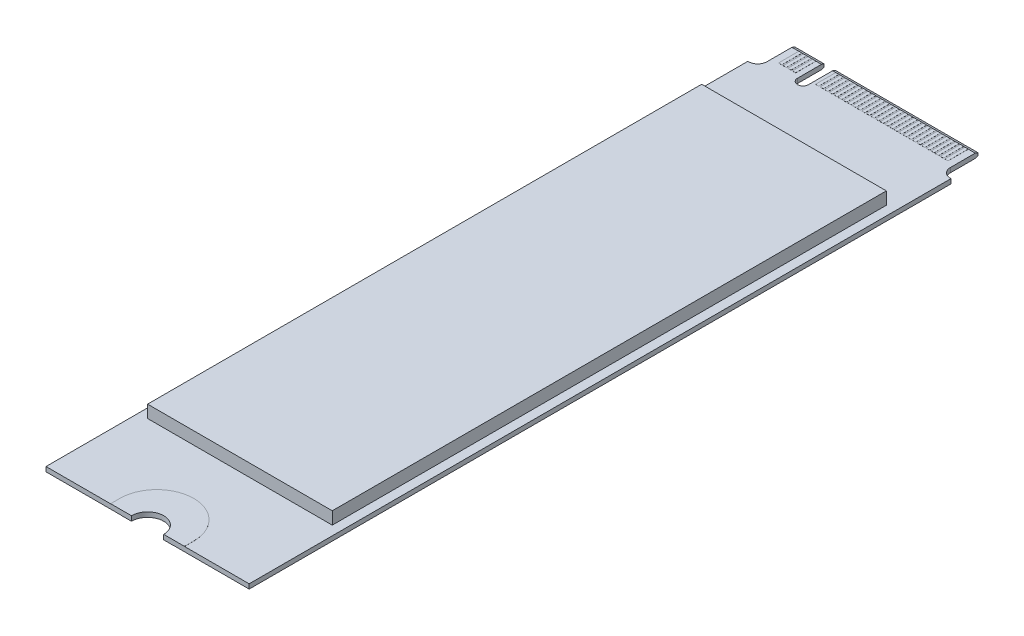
from build123d import *

# Parameters (mm, degrees)
BOSS_EXTRUDE1_DEPTH  = 0.5
CUT_EXTRUDE2_DEPTH   = 46.145383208
SKETCH7_W            = 20
SKETCH7_H            = 60
BOSS_EXTRUDE3_DEPTH  = 1.35
BOSS_EXTRUDE6_DEPTH  = 0.01
BOSS_EXTRUDE9_START  = 0.01
BOSS_EXTRUDE9_DEPTH  = 0.01
BOSS_EXTRUDE10_REACH = 45.572
BOSS_EXTRUDE11_START = -0.5
BOSS_EXTRUDE11_DEPTH = 0.5
SKETCH18_W           = 0.347153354
SKETCH18_H           = 1.7
BOSS_EXTRUDE12_DEPTH = 0.01
SKETCH19_W           = 0.35
SKETCH19_H           = 1.7
BOSS_EXTRUDE13_DEPTH = 0.01
SKETCH21_W           = 0.35
SKETCH21_H           = 2.2
BOSS_EXTRUDE15_DEPTH = 0.01


with BuildPart() as part:
    # Sketch1 → Boss-Extrude1 (new body)
    with BuildSketch(Plane(origin=(0, 0, 0), x_dir=(1, 0, 0), z_dir=(0, 1, 0))):
        with BuildLine():
            Line((1.75, -40), (11, -40))
            Line((11, -40), (11, 36))
            Line((11, 36), (10.925, 36))
            ThreePointArc((10.925, 36), (10.217893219, 36.292893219), (9.925, 37))
            Line((9.925, 37), (9.925, 40))
            Line((9.925, 40), (6.225, 40))
            Line((6.225, 40), (6.225, 37.1))
            ThreePointArc((6.225, 37.1), (5.625, 36.5), (5.025, 37.1))
            Line((5.025, 37.1), (5.025, 40))
            Line((5.025, 40), (0, 40))
            Line((0, 40), (-5.525, 40))
            Line((-5.525, 40), (-5.525, 37.1))
            ThreePointArc((-5.525, 37.1), (-6.125, 36.5), (-6.725, 37.1))
            Line((-6.725, 37.1), (-6.725, 40))
            Line((-6.725, 40), (-9.925, 40))
            Line((-9.925, 40), (-9.925, 37))
            ThreePointArc((-9.925, 37), (-10.217893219, 36.292893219), (-10.925, 36))
            Line((-10.925, 36), (-11, 36))
            Line((-11, 36), (-11, -40))
            Line((-11, -40), (-1.75, -40))
            ThreePointArc((-1.75, -40), (0, -38.25), (1.75, -40))
        make_face()
    extrude(amount=-BOSS_EXTRUDE1_DEPTH)

    # Sketch5 → Cut-Extrude2 (cut, through all)
    with BuildSketch(Plane(origin=(9.925, 0, 0), x_dir=(0, 0, -1), z_dir=(1, 0, 0))):
        Polygon((40, 0), (39.7, 0), (40, -0.10919107), align=None)
        Polygon((40, -0.39080893), (39.7, -0.5), (40, -0.5), align=None)
    extrude(amount=-CUT_EXTRUDE2_DEPTH, mode=Mode.SUBTRACT)

    # Sketch7 → Boss-Extrude3 (add)
    with BuildSketch(Plane(origin=(0, 0, 0), x_dir=(1, 0, 0), z_dir=(0, 1, 0))):
        Rectangle(SKETCH7_W, SKETCH7_H)
    extrude(amount=BOSS_EXTRUDE3_DEPTH)

    # Sketch12 → Boss-Extrude6 (add)
    with BuildSketch(Plane.XZ.offset(0.5)):
        with BuildLine():
            Line((-2.75, 40), (-1.75, 40))
            ThreePointArc((-1.75, 40), (0, 38.25), (1.75, 40))
            Line((1.75, 40), (2.75, 40))
            ThreePointArc((2.75, 40), (0, 37.25), (-2.75, 40))
        make_face()
    extrude(amount=BOSS_EXTRUDE6_DEPTH)

    # Sketch15 → Boss-Extrude9 (add)
    with BuildSketch(Plane(origin=(0, 0, 0), x_dir=(1, 0, 0), z_dir=(0, 1, 0)).offset(BOSS_EXTRUDE9_START)):
        with BuildLine():
            Line((-4, -40), (-4, -39))
            ThreePointArc((-4, -39), (0, -35), (4, -39))
            Line((4, -39), (4, -40))
            Line((4, -40), (1.75, -40))
            ThreePointArc((1.75, -40), (0, -38.25), (-1.75, -40))
            Line((-1.75, -40), (-4, -40))
        make_face()
    extrude(amount=-BOSS_EXTRUDE9_DEPTH)

    # Sketch16 → Boss-Extrude10 (add, up to next)
    with BuildSketch(Plane.ZY.offset(-6.225), mode=Mode.PRIVATE) as boss_extrude10_sk1:
        Polygon((-39.7, -0.5), (-40, -0.39080893), (-40, -0.10919107), (-39.7, 0), (-37.1, 0), (-37.1, -0.5), align=None)
    boss_extrude10_tool1 = extrude(boss_extrude10_sk1.sketch, amount=BOSS_EXTRUDE10_REACH, mode=Mode.PRIVATE) - part.part
    add(boss_extrude10_tool1.solids().sort_by_distance((6.225, -0.25, -38.518797))[0])

    # Sketch17 → Boss-Extrude11 (add)
    with BuildSketch(Plane.XZ.offset(0.5).offset(BOSS_EXTRUDE11_START)):
        with BuildLine():
            Line((5.025, -37.1), (6.225, -37.1))
            ThreePointArc((6.225, -37.1), (5.625, -36.5), (5.025, -37.1))
        make_face()
    extrude(amount=BOSS_EXTRUDE11_DEPTH)

    # Sketch18 → Boss-Extrude12 (add)
    with BuildSketch(Plane.XZ.offset(0.5)):
        with Locations((-9.243710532, -38.85)):
            Rectangle(SKETCH18_W, SKETCH18_H)
        with Locations((-8.743710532, -38.85)):
            Rectangle(SKETCH18_W, SKETCH18_H)
        with Locations((-8.243710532, -38.85)):
            Rectangle(SKETCH18_W, SKETCH18_H)
        with Locations((-7.743710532, -38.85)):
            Rectangle(SKETCH18_W, SKETCH18_H)
        with Locations((-7.243710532, -38.85)):
            Rectangle(SKETCH18_W, SKETCH18_H)
    extrude(amount=BOSS_EXTRUDE12_DEPTH)

    # Sketch19 → Boss-Extrude13 (add)
    with BuildSketch(Plane.XZ.offset(0.5)):
        with Locations((9.25, -38.85)):
            Rectangle(SKETCH19_W, SKETCH19_H)
        with Locations((8.75, -38.85)):
            Rectangle(SKETCH19_W, SKETCH19_H)
        with Locations((8.25, -38.85)):
            Rectangle(SKETCH19_W, SKETCH19_H)
        with Locations((7.75, -38.85)):
            Rectangle(SKETCH19_W, SKETCH19_H)
        with Locations((7.25, -38.85)):
            Rectangle(SKETCH19_W, SKETCH19_H)
        with Locations((6.75, -38.85)):
            Rectangle(SKETCH19_W, SKETCH19_H)
        with Locations((6.25, -38.85)):
            Rectangle(SKETCH19_W, SKETCH19_H)
        with Locations((5.75, -38.85)):
            Rectangle(SKETCH19_W, SKETCH19_H)
        with Locations((5.25, -38.85)):
            Rectangle(SKETCH19_W, SKETCH19_H)
        with Locations((4.75, -38.85)):
            Rectangle(SKETCH19_W, SKETCH19_H)
        with Locations((4.25, -38.85)):
            Rectangle(SKETCH19_W, SKETCH19_H)
        with Locations((3.75, -38.85)):
            Rectangle(SKETCH19_W, SKETCH19_H)
        with Locations((3.25, -38.85)):
            Rectangle(SKETCH19_W, SKETCH19_H)
        with Locations((2.75, -38.85)):
            Rectangle(SKETCH19_W, SKETCH19_H)
        with Locations((2.25, -38.85)):
            Rectangle(SKETCH19_W, SKETCH19_H)
        with Locations((1.75, -38.85)):
            Rectangle(SKETCH19_W, SKETCH19_H)
        with Locations((1.25, -38.85)):
            Rectangle(SKETCH19_W, SKETCH19_H)
        with Locations((0.75, -38.85)):
            Rectangle(SKETCH19_W, SKETCH19_H)
        with Locations((0.25, -38.85)):
            Rectangle(SKETCH19_W, SKETCH19_H)
        with Locations((-0.25, -38.85)):
            Rectangle(SKETCH19_W, SKETCH19_H)
        with Locations((-0.75, -38.85)):
            Rectangle(SKETCH19_W, SKETCH19_H)
        with Locations((-1.25, -38.85)):
            Rectangle(SKETCH19_W, SKETCH19_H)
        with Locations((-1.75, -38.85)):
            Rectangle(SKETCH19_W, SKETCH19_H)
        with Locations((-2.25, -38.85)):
            Rectangle(SKETCH19_W, SKETCH19_H)
        with Locations((-2.75, -38.85)):
            Rectangle(SKETCH19_W, SKETCH19_H)
        with Locations((-3.25, -38.85)):
            Rectangle(SKETCH19_W, SKETCH19_H)
        with Locations((-3.75, -38.85)):
            Rectangle(SKETCH19_W, SKETCH19_H)
        with Locations((-4.25, -38.85)):
            Rectangle(SKETCH19_W, SKETCH19_H)
        with Locations((-4.75, -38.85)):
            Rectangle(SKETCH19_W, SKETCH19_H)
    extrude(amount=BOSS_EXTRUDE13_DEPTH)

    # Sketch21 → Boss-Extrude15 (add)
    with BuildSketch(Plane(origin=(0, 0, 0), x_dir=(1, 0, 0), z_dir=(0, 1, 0))):
        with Locations((8.502777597, 38.6)):
            Rectangle(SKETCH21_W, SKETCH21_H)
        with Locations((9.002777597, 38.6)):
            Rectangle(SKETCH21_W, SKETCH21_H)
        with Locations((8.002777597, 38.6)):
            Rectangle(SKETCH21_W, SKETCH21_H)
        with Locations((7.502777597, 38.6)):
            Rectangle(SKETCH21_W, SKETCH21_H)
        with Locations((7.002777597, 38.6)):
            Rectangle(SKETCH21_W, SKETCH21_H)
        with Locations((6.502777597, 38.6)):
            Rectangle(SKETCH21_W, SKETCH21_H)
        with Locations((6.002777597, 38.6)):
            Rectangle(SKETCH21_W, SKETCH21_H)
        with Locations((5.502777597, 38.6)):
            Rectangle(SKETCH21_W, SKETCH21_H)
        with Locations((5.002777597, 38.6)):
            Rectangle(SKETCH21_W, SKETCH21_H)
        with Locations((4.502777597, 38.6)):
            Rectangle(SKETCH21_W, SKETCH21_H)
        with Locations((4.002777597, 38.6)):
            Rectangle(SKETCH21_W, SKETCH21_H)
        with Locations((3.502777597, 38.6)):
            Rectangle(SKETCH21_W, SKETCH21_H)
        with Locations((3.002777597, 38.6)):
            Rectangle(SKETCH21_W, SKETCH21_H)
        with Locations((2.502777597, 38.6)):
            Rectangle(SKETCH21_W, SKETCH21_H)
        with Locations((2.002777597, 38.6)):
            Rectangle(SKETCH21_W, SKETCH21_H)
        with Locations((1.502777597, 38.6)):
            Rectangle(SKETCH21_W, SKETCH21_H)
        with Locations((1.002777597, 38.6)):
            Rectangle(SKETCH21_W, SKETCH21_H)
        with Locations((0.502777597, 38.6)):
            Rectangle(SKETCH21_W, SKETCH21_H)
        with Locations((0.002777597, 38.6)):
            Rectangle(SKETCH21_W, SKETCH21_H)
        with Locations((-0.497222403, 38.6)):
            Rectangle(SKETCH21_W, SKETCH21_H)
        with Locations((-0.997222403, 38.6)):
            Rectangle(SKETCH21_W, SKETCH21_H)
        with Locations((-1.497222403, 38.6)):
            Rectangle(SKETCH21_W, SKETCH21_H)
        with Locations((-1.997222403, 38.6)):
            Rectangle(SKETCH21_W, SKETCH21_H)
        with Locations((-2.497222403, 38.6)):
            Rectangle(SKETCH21_W, SKETCH21_H)
        with Locations((-2.997222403, 38.6)):
            Rectangle(SKETCH21_W, SKETCH21_H)
        with Locations((-3.497222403, 38.6)):
            Rectangle(SKETCH21_W, SKETCH21_H)
        with Locations((-3.997222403, 38.6)):
            Rectangle(SKETCH21_W, SKETCH21_H)
        with Locations((-4.497222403, 38.6)):
            Rectangle(SKETCH21_W, SKETCH21_H)
        with Locations((-4.997222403, 38.6)):
            Rectangle(SKETCH21_W, SKETCH21_H)
        with Locations((-7.497222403, 38.6)):
            Rectangle(SKETCH21_W, SKETCH21_H)
        with Locations((-7.997222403, 38.6)):
            Rectangle(SKETCH21_W, SKETCH21_H)
        with Locations((-8.497222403, 38.6)):
            Rectangle(SKETCH21_W, SKETCH21_H)
        with Locations((-8.997222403, 38.6)):
            Rectangle(SKETCH21_W, SKETCH21_H)
    extrude(amount=BOSS_EXTRUDE15_DEPTH)


solid = part.part
